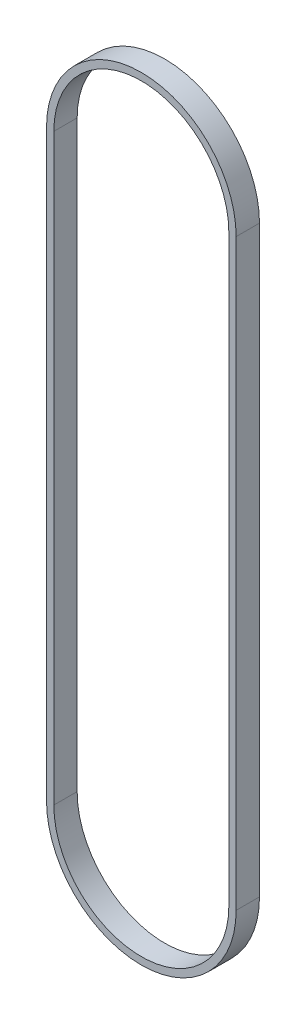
ISO-10303-21;
HEADER;
FILE_DESCRIPTION(('STEP AP214'),'2;1');
FILE_NAME('part.step','',(''),(''),'','','');
FILE_SCHEMA(('AUTOMOTIVE_DESIGN { 1 0 10303 214 1 1 1 1 }'));
ENDSEC;
DATA;
#1=APPLICATION_CONTEXT('core data for automotive mechanical design processes');
#2=APPLICATION_PROTOCOL_DEFINITION('international standard','automotive_design',2000,#1);
#3=PRODUCT_CONTEXT('',#1,'mechanical');
#4=PRODUCT('Part','Part','',(#3));
#5=PRODUCT_RELATED_PRODUCT_CATEGORY('part','',(#4));
#6=PRODUCT_DEFINITION_FORMATION('','',#4);
#7=PRODUCT_DEFINITION_CONTEXT('part definition',#1,'design');
#8=PRODUCT_DEFINITION('design','',#6,#7);
#9=PRODUCT_DEFINITION_SHAPE('','',#8);
#10=(LENGTH_UNIT() NAMED_UNIT(*) SI_UNIT(.MILLI.,.METRE.));
#11=(NAMED_UNIT(*) PLANE_ANGLE_UNIT() SI_UNIT($,.RADIAN.));
#12=(NAMED_UNIT(*) SI_UNIT($,.STERADIAN.) SOLID_ANGLE_UNIT());
#13=UNCERTAINTY_MEASURE_WITH_UNIT(LENGTH_MEASURE(1.E-05),#10,'distance_accuracy_value','');
#14=(GEOMETRIC_REPRESENTATION_CONTEXT(3) GLOBAL_UNCERTAINTY_ASSIGNED_CONTEXT((#13)) GLOBAL_UNIT_ASSIGNED_CONTEXT((#10,
#11,#12)) REPRESENTATION_CONTEXT('',''));
#15=CARTESIAN_POINT('',(0.,0.,0.));
#16=DIRECTION('',(0.,0.,1.));
#17=DIRECTION('',(1.,0.,0.));
#18=AXIS2_PLACEMENT_3D('',#15,#16,#17);
#19=CARTESIAN_POINT('',(0.,0.,16.));
#20=DIRECTION('',(0.,0.,1.));
#21=DIRECTION('',(1.,0.,0.));
#22=AXIS2_PLACEMENT_3D('',#19,#20,#21);
#23=PLANE('',#22);
#24=CARTESIAN_POINT('',(0.,0.,16.));
#25=DIRECTION('',(0.,0.,1.));
#26=DIRECTION('',(1.,0.,0.));
#27=AXIS2_PLACEMENT_3D('',#24,#25,#26);
#28=CIRCLE('',#27,65.);
#29=CARTESIAN_POINT('',(65.,0.,16.));
#30=VERTEX_POINT('',#29);
#31=CARTESIAN_POINT('',(-65.,0.,16.));
#32=VERTEX_POINT('',#31);
#33=EDGE_CURVE('E141',#30,#32,#28,.T.);
#34=ORIENTED_EDGE('',*,*,#33,.T.);
#35=DIRECTION('',(0.,-1.,0.));
#36=VECTOR('',#35,1.);
#37=CARTESIAN_POINT('',(-65.,0.,16.));
#38=LINE('',#37,#36);
#39=CARTESIAN_POINT('',(-65.,-400.,16.));
#40=VERTEX_POINT('',#39);
#41=EDGE_CURVE('E144',#32,#40,#38,.T.);
#42=ORIENTED_EDGE('',*,*,#41,.T.);
#43=CARTESIAN_POINT('',(0.,-400.,16.));
#44=DIRECTION('',(0.,0.,1.));
#45=DIRECTION('',(1.,0.,0.));
#46=AXIS2_PLACEMENT_3D('',#43,#44,#45);
#47=CIRCLE('',#46,65.);
#48=CARTESIAN_POINT('',(65.,-400.,16.));
#49=VERTEX_POINT('',#48);
#50=EDGE_CURVE('E146',#40,#49,#47,.T.);
#51=ORIENTED_EDGE('',*,*,#50,.T.);
#52=DIRECTION('',(0.,1.,0.));
#53=VECTOR('',#52,1.);
#54=CARTESIAN_POINT('',(65.,0.,16.));
#55=LINE('',#54,#53);
#56=EDGE_CURVE('E148',#49,#30,#55,.T.);
#57=ORIENTED_EDGE('',*,*,#56,.T.);
#58=EDGE_LOOP('',(#34,#42,#51,#57));
#59=FACE_BOUND('',#58,.T.);
#60=DIRECTION('',(0.,-1.,0.));
#61=VECTOR('',#60,1.);
#62=CARTESIAN_POINT('',(-60.,0.,16.));
#63=LINE('',#62,#61);
#64=CARTESIAN_POINT('',(-60.,0.,16.));
#65=VERTEX_POINT('',#64);
#66=CARTESIAN_POINT('',(-60.,-400.,16.));
#67=VERTEX_POINT('',#66);
#68=EDGE_CURVE('E123',#65,#67,#63,.T.);
#69=ORIENTED_EDGE('',*,*,#68,.F.);
#70=CARTESIAN_POINT('',(0.,0.,16.));
#71=DIRECTION('',(0.,0.,1.));
#72=DIRECTION('',(1.,0.,0.));
#73=AXIS2_PLACEMENT_3D('',#70,#71,#72);
#74=CIRCLE('',#73,60.);
#75=CARTESIAN_POINT('',(60.,0.,16.));
#76=VERTEX_POINT('',#75);
#77=EDGE_CURVE('E112',#76,#65,#74,.T.);
#78=ORIENTED_EDGE('',*,*,#77,.F.);
#79=DIRECTION('',(0.,1.,0.));
#80=VECTOR('',#79,1.);
#81=CARTESIAN_POINT('',(60.,0.,16.));
#82=LINE('',#81,#80);
#83=CARTESIAN_POINT('',(60.,-400.,16.));
#84=VERTEX_POINT('',#83);
#85=EDGE_CURVE('E127',#84,#76,#82,.T.);
#86=ORIENTED_EDGE('',*,*,#85,.F.);
#87=CARTESIAN_POINT('',(0.,-400.,16.));
#88=DIRECTION('',(0.,0.,1.));
#89=DIRECTION('',(1.,0.,0.));
#90=AXIS2_PLACEMENT_3D('',#87,#88,#89);
#91=CIRCLE('',#90,60.);
#92=EDGE_CURVE('E125',#67,#84,#91,.T.);
#93=ORIENTED_EDGE('',*,*,#92,.F.);
#94=EDGE_LOOP('',(#69,#78,#86,#93));
#95=FACE_BOUND('',#94,.T.);
#96=ADVANCED_FACE('F32',(#59,#95),#23,.T.);
#97=CARTESIAN_POINT('',(0.,0.,0.));
#98=DIRECTION('',(0.,0.,1.));
#99=DIRECTION('',(1.,0.,0.));
#100=AXIS2_PLACEMENT_3D('',#97,#98,#99);
#101=PLANE('',#100);
#102=CARTESIAN_POINT('',(0.,0.,0.));
#103=DIRECTION('',(0.,0.,1.));
#104=DIRECTION('',(1.,0.,0.));
#105=AXIS2_PLACEMENT_3D('',#102,#103,#104);
#106=CIRCLE('',#105,65.);
#107=CARTESIAN_POINT('',(65.,0.,0.));
#108=VERTEX_POINT('',#107);
#109=CARTESIAN_POINT('',(-65.,0.,0.));
#110=VERTEX_POINT('',#109);
#111=EDGE_CURVE('E113',#108,#110,#106,.T.);
#112=ORIENTED_EDGE('',*,*,#111,.F.);
#113=DIRECTION('',(0.,1.,0.));
#114=VECTOR('',#113,1.);
#115=CARTESIAN_POINT('',(65.,0.,0.));
#116=LINE('',#115,#114);
#117=CARTESIAN_POINT('',(65.,-400.,0.));
#118=VERTEX_POINT('',#117);
#119=EDGE_CURVE('E139',#118,#108,#116,.T.);
#120=ORIENTED_EDGE('',*,*,#119,.F.);
#121=CARTESIAN_POINT('',(0.,-400.,0.));
#122=DIRECTION('',(0.,0.,1.));
#123=DIRECTION('',(1.,0.,0.));
#124=AXIS2_PLACEMENT_3D('',#121,#122,#123);
#125=CIRCLE('',#124,65.);
#126=CARTESIAN_POINT('',(-65.,-400.,0.));
#127=VERTEX_POINT('',#126);
#128=EDGE_CURVE('E137',#127,#118,#125,.T.);
#129=ORIENTED_EDGE('',*,*,#128,.F.);
#130=DIRECTION('',(0.,-1.,0.));
#131=VECTOR('',#130,1.);
#132=CARTESIAN_POINT('',(-65.,0.,0.));
#133=LINE('',#132,#131);
#134=EDGE_CURVE('E135',#110,#127,#133,.T.);
#135=ORIENTED_EDGE('',*,*,#134,.F.);
#136=EDGE_LOOP('',(#112,#120,#129,#135));
#137=FACE_BOUND('',#136,.T.);
#138=CARTESIAN_POINT('',(0.,0.,0.));
#139=DIRECTION('',(0.,0.,1.));
#140=DIRECTION('',(1.,0.,0.));
#141=AXIS2_PLACEMENT_3D('',#138,#139,#140);
#142=CIRCLE('',#141,60.);
#143=CARTESIAN_POINT('',(60.,0.,0.));
#144=VERTEX_POINT('',#143);
#145=CARTESIAN_POINT('',(-60.,0.,0.));
#146=VERTEX_POINT('',#145);
#147=EDGE_CURVE('E55',#144,#146,#142,.T.);
#148=ORIENTED_EDGE('',*,*,#147,.T.);
#149=DIRECTION('',(0.,-1.,0.));
#150=VECTOR('',#149,1.);
#151=CARTESIAN_POINT('',(-60.,0.,0.));
#152=LINE('',#151,#150);
#153=CARTESIAN_POINT('',(-60.,-400.,0.));
#154=VERTEX_POINT('',#153);
#155=EDGE_CURVE('E99',#146,#154,#152,.T.);
#156=ORIENTED_EDGE('',*,*,#155,.T.);
#157=CARTESIAN_POINT('',(0.,-400.,0.));
#158=DIRECTION('',(0.,0.,1.));
#159=DIRECTION('',(1.,0.,0.));
#160=AXIS2_PLACEMENT_3D('',#157,#158,#159);
#161=CIRCLE('',#160,60.);
#162=CARTESIAN_POINT('',(60.,-400.,0.));
#163=VERTEX_POINT('',#162);
#164=EDGE_CURVE('E108',#154,#163,#161,.T.);
#165=ORIENTED_EDGE('',*,*,#164,.T.);
#166=DIRECTION('',(0.,1.,0.));
#167=VECTOR('',#166,1.);
#168=CARTESIAN_POINT('',(60.,0.,0.));
#169=LINE('',#168,#167);
#170=EDGE_CURVE('E117',#163,#144,#169,.T.);
#171=ORIENTED_EDGE('',*,*,#170,.T.);
#172=EDGE_LOOP('',(#148,#156,#165,#171));
#173=FACE_BOUND('',#172,.T.);
#174=ADVANCED_FACE('F116',(#137,#173),#101,.F.);
#175=CARTESIAN_POINT('',(0.,0.,16.));
#176=DIRECTION('',(0.,0.,-1.));
#177=DIRECTION('',(-1.,0.,0.));
#178=AXIS2_PLACEMENT_3D('',#175,#176,#177);
#179=CYLINDRICAL_SURFACE('',#178,65.);
#180=ORIENTED_EDGE('',*,*,#111,.T.);
#181=DIRECTION('',(0.,0.,-1.));
#182=VECTOR('',#181,1.);
#183=CARTESIAN_POINT('',(-65.,0.,16.));
#184=LINE('',#183,#182);
#185=EDGE_CURVE('E11',#32,#110,#184,.T.);
#186=ORIENTED_EDGE('',*,*,#185,.F.);
#187=ORIENTED_EDGE('',*,*,#33,.F.);
#188=DIRECTION('',(0.,0.,-1.));
#189=VECTOR('',#188,1.);
#190=CARTESIAN_POINT('',(65.,0.,16.));
#191=LINE('',#190,#189);
#192=EDGE_CURVE('E150',#30,#108,#191,.T.);
#193=ORIENTED_EDGE('',*,*,#192,.T.);
#194=EDGE_LOOP('',(#180,#186,#187,#193));
#195=FACE_BOUND('',#194,.T.);
#196=ADVANCED_FACE('F34',(#195),#179,.T.);
#197=CARTESIAN_POINT('',(-65.,0.,16.));
#198=DIRECTION('',(1.,0.,0.));
#199=DIRECTION('',(0.,0.,-1.));
#200=AXIS2_PLACEMENT_3D('',#197,#198,#199);
#201=PLANE('',#200);
#202=ORIENTED_EDGE('',*,*,#134,.T.);
#203=DIRECTION('',(0.,0.,-1.));
#204=VECTOR('',#203,1.);
#205=CARTESIAN_POINT('',(-65.,-400.,16.));
#206=LINE('',#205,#204);
#207=EDGE_CURVE('E40',#40,#127,#206,.T.);
#208=ORIENTED_EDGE('',*,*,#207,.F.);
#209=ORIENTED_EDGE('',*,*,#41,.F.);
#210=ORIENTED_EDGE('',*,*,#185,.T.);
#211=EDGE_LOOP('',(#202,#208,#209,#210));
#212=FACE_BOUND('',#211,.T.);
#213=ADVANCED_FACE('F175',(#212),#201,.F.);
#214=CARTESIAN_POINT('',(0.,-400.,16.));
#215=DIRECTION('',(0.,0.,-1.));
#216=DIRECTION('',(-1.,0.,0.));
#217=AXIS2_PLACEMENT_3D('',#214,#215,#216);
#218=CYLINDRICAL_SURFACE('',#217,65.);
#219=ORIENTED_EDGE('',*,*,#128,.T.);
#220=DIRECTION('',(0.,0.,-1.));
#221=VECTOR('',#220,1.);
#222=CARTESIAN_POINT('',(65.,-400.,16.));
#223=LINE('',#222,#221);
#224=EDGE_CURVE('E153',#49,#118,#223,.T.);
#225=ORIENTED_EDGE('',*,*,#224,.F.);
#226=ORIENTED_EDGE('',*,*,#50,.F.);
#227=ORIENTED_EDGE('',*,*,#207,.T.);
#228=EDGE_LOOP('',(#219,#225,#226,#227));
#229=FACE_BOUND('',#228,.T.);
#230=ADVANCED_FACE('F160',(#229),#218,.T.);
#231=CARTESIAN_POINT('',(65.,0.,16.));
#232=DIRECTION('',(-1.,0.,0.));
#233=DIRECTION('',(0.,0.,1.));
#234=AXIS2_PLACEMENT_3D('',#231,#232,#233);
#235=PLANE('',#234);
#236=ORIENTED_EDGE('',*,*,#119,.T.);
#237=ORIENTED_EDGE('',*,*,#192,.F.);
#238=ORIENTED_EDGE('',*,*,#56,.F.);
#239=ORIENTED_EDGE('',*,*,#224,.T.);
#240=EDGE_LOOP('',(#236,#237,#238,#239));
#241=FACE_BOUND('',#240,.T.);
#242=ADVANCED_FACE('F168',(#241),#235,.F.);
#243=CARTESIAN_POINT('',(0.,0.,16.));
#244=DIRECTION('',(0.,0.,-1.));
#245=DIRECTION('',(-1.,0.,0.));
#246=AXIS2_PLACEMENT_3D('',#243,#244,#245);
#247=CYLINDRICAL_SURFACE('',#246,60.);
#248=ORIENTED_EDGE('',*,*,#147,.F.);
#249=DIRECTION('',(0.,0.,-1.));
#250=VECTOR('',#249,1.);
#251=CARTESIAN_POINT('',(60.,0.,16.));
#252=LINE('',#251,#250);
#253=EDGE_CURVE('E129',#76,#144,#252,.T.);
#254=ORIENTED_EDGE('',*,*,#253,.F.);
#255=ORIENTED_EDGE('',*,*,#77,.T.);
#256=DIRECTION('',(0.,0.,-1.));
#257=VECTOR('',#256,1.);
#258=CARTESIAN_POINT('',(-60.,0.,16.));
#259=LINE('',#258,#257);
#260=EDGE_CURVE('E101',#65,#146,#259,.T.);
#261=ORIENTED_EDGE('',*,*,#260,.T.);
#262=EDGE_LOOP('',(#248,#254,#255,#261));
#263=FACE_BOUND('',#262,.T.);
#264=ADVANCED_FACE('F110',(#263),#247,.F.);
#265=CARTESIAN_POINT('',(-60.,0.,16.));
#266=DIRECTION('',(1.,0.,0.));
#267=DIRECTION('',(0.,1.,0.));
#268=AXIS2_PLACEMENT_3D('',#265,#266,#267);
#269=PLANE('',#268);
#270=ORIENTED_EDGE('',*,*,#155,.F.);
#271=ORIENTED_EDGE('',*,*,#260,.F.);
#272=ORIENTED_EDGE('',*,*,#68,.T.);
#273=DIRECTION('',(0.,0.,-1.));
#274=VECTOR('',#273,1.);
#275=CARTESIAN_POINT('',(-60.,-400.,16.));
#276=LINE('',#275,#274);
#277=EDGE_CURVE('E104',#67,#154,#276,.T.);
#278=ORIENTED_EDGE('',*,*,#277,.T.);
#279=EDGE_LOOP('',(#270,#271,#272,#278));
#280=FACE_BOUND('',#279,.T.);
#281=ADVANCED_FACE('F100',(#280),#269,.T.);
#282=CARTESIAN_POINT('',(0.,-400.,16.));
#283=DIRECTION('',(0.,0.,-1.));
#284=DIRECTION('',(-1.,0.,0.));
#285=AXIS2_PLACEMENT_3D('',#282,#283,#284);
#286=CYLINDRICAL_SURFACE('',#285,60.);
#287=ORIENTED_EDGE('',*,*,#164,.F.);
#288=ORIENTED_EDGE('',*,*,#277,.F.);
#289=ORIENTED_EDGE('',*,*,#92,.T.);
#290=DIRECTION('',(0.,0.,-1.));
#291=VECTOR('',#290,1.);
#292=CARTESIAN_POINT('',(60.,-400.,16.));
#293=LINE('',#292,#291);
#294=EDGE_CURVE('E47',#84,#163,#293,.T.);
#295=ORIENTED_EDGE('',*,*,#294,.T.);
#296=EDGE_LOOP('',(#287,#288,#289,#295));
#297=FACE_BOUND('',#296,.T.);
#298=ADVANCED_FACE('F197',(#297),#286,.F.);
#299=CARTESIAN_POINT('',(60.,0.,16.));
#300=DIRECTION('',(-1.,0.,0.));
#301=DIRECTION('',(0.,0.,1.));
#302=AXIS2_PLACEMENT_3D('',#299,#300,#301);
#303=PLANE('',#302);
#304=ORIENTED_EDGE('',*,*,#170,.F.);
#305=ORIENTED_EDGE('',*,*,#294,.F.);
#306=ORIENTED_EDGE('',*,*,#85,.T.);
#307=ORIENTED_EDGE('',*,*,#253,.T.);
#308=EDGE_LOOP('',(#304,#305,#306,#307));
#309=FACE_BOUND('',#308,.T.);
#310=ADVANCED_FACE('F202',(#309),#303,.T.);
#311=CLOSED_SHELL('',(#96,#174,#196,#213,#230,#242,#264,#281,#298,#310));
#312=MANIFOLD_SOLID_BREP('B2',#311);
#313=ADVANCED_BREP_SHAPE_REPRESENTATION('',(#18,#312),#14);
#314=SHAPE_DEFINITION_REPRESENTATION(#9,#313);
ENDSEC;
END-ISO-10303-21;
